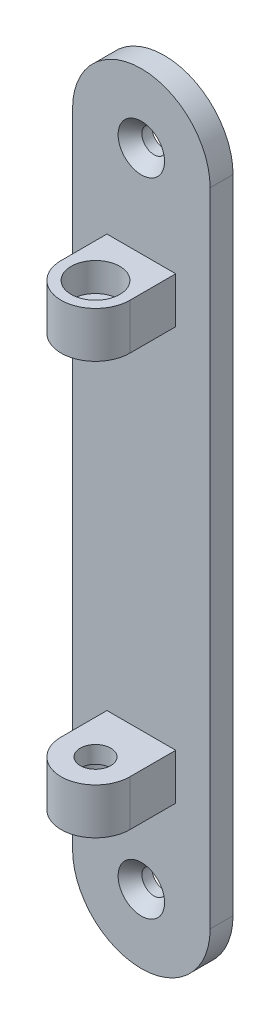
ISO-10303-21;
HEADER;
FILE_DESCRIPTION(('STEP AP214'),'2;1');
FILE_NAME('part.step','',(''),(''),'','','');
FILE_SCHEMA(('AUTOMOTIVE_DESIGN { 1 0 10303 214 1 1 1 1 }'));
ENDSEC;
DATA;
#1=APPLICATION_CONTEXT('core data for automotive mechanical design processes');
#2=APPLICATION_PROTOCOL_DEFINITION('international standard','automotive_design',2000,#1);
#3=PRODUCT_CONTEXT('',#1,'mechanical');
#4=PRODUCT('Part','Part','',(#3));
#5=PRODUCT_RELATED_PRODUCT_CATEGORY('part','',(#4));
#6=PRODUCT_DEFINITION_FORMATION('','',#4);
#7=PRODUCT_DEFINITION_CONTEXT('part definition',#1,'design');
#8=PRODUCT_DEFINITION('design','',#6,#7);
#9=PRODUCT_DEFINITION_SHAPE('','',#8);
#10=(LENGTH_UNIT() NAMED_UNIT(*) SI_UNIT(.MILLI.,.METRE.));
#11=(NAMED_UNIT(*) PLANE_ANGLE_UNIT() SI_UNIT($,.RADIAN.));
#12=(NAMED_UNIT(*) SI_UNIT($,.STERADIAN.) SOLID_ANGLE_UNIT());
#13=UNCERTAINTY_MEASURE_WITH_UNIT(LENGTH_MEASURE(1.E-05),#10,'distance_accuracy_value','');
#14=(GEOMETRIC_REPRESENTATION_CONTEXT(3) GLOBAL_UNCERTAINTY_ASSIGNED_CONTEXT((#13)) GLOBAL_UNIT_ASSIGNED_CONTEXT((#10,
#11,#12)) REPRESENTATION_CONTEXT('',''));
#15=CARTESIAN_POINT('',(0.,0.,0.));
#16=DIRECTION('',(0.,0.,1.));
#17=DIRECTION('',(1.,0.,0.));
#18=AXIS2_PLACEMENT_3D('',#15,#16,#17);
#19=CARTESIAN_POINT('',(19.05,88.9,6.35));
#20=DIRECTION('',(0.,0.,-1.));
#21=DIRECTION('',(-1.,0.,0.));
#22=AXIS2_PLACEMENT_3D('',#19,#20,#21);
#23=PLANE('',#22);
#24=DIRECTION('',(0.,-1.,0.));
#25=VECTOR('',#24,1.);
#26=CARTESIAN_POINT('',(9.525,63.5,6.35));
#27=LINE('',#26,#25);
#28=CARTESIAN_POINT('',(9.525,63.5,6.35));
#29=VERTEX_POINT('',#28);
#30=CARTESIAN_POINT('',(9.525,50.8,6.35));
#31=VERTEX_POINT('',#30);
#32=EDGE_CURVE('E189',#29,#31,#27,.T.);
#33=ORIENTED_EDGE('',*,*,#32,.F.);
#34=DIRECTION('',(-1.,0.,0.));
#35=VECTOR('',#34,1.);
#36=CARTESIAN_POINT('',(9.525,63.5,6.35));
#37=LINE('',#36,#35);
#38=CARTESIAN_POINT('',(28.575,63.5,6.35));
#39=VERTEX_POINT('',#38);
#40=EDGE_CURVE('E200',#39,#29,#37,.T.);
#41=ORIENTED_EDGE('',*,*,#40,.F.);
#42=DIRECTION('',(0.,1.,0.));
#43=VECTOR('',#42,1.);
#44=CARTESIAN_POINT('',(28.575,63.5,6.35));
#45=LINE('',#44,#43);
#46=CARTESIAN_POINT('',(28.575,50.8,6.35));
#47=VERTEX_POINT('',#46);
#48=EDGE_CURVE('E197',#47,#39,#45,.T.);
#49=ORIENTED_EDGE('',*,*,#48,.F.);
#50=DIRECTION('',(1.,0.,0.));
#51=VECTOR('',#50,1.);
#52=CARTESIAN_POINT('',(9.52500000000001,50.8,6.35));
#53=LINE('',#52,#51);
#54=EDGE_CURVE('E194',#31,#47,#53,.T.);
#55=ORIENTED_EDGE('',*,*,#54,.F.);
#56=EDGE_LOOP('',(#33,#41,#49,#55));
#57=FACE_BOUND('',#56,.T.);
#58=CARTESIAN_POINT('',(19.05,88.9,6.35));
#59=DIRECTION('',(0.,0.,1.));
#60=DIRECTION('',(1.,0.,0.));
#61=AXIS2_PLACEMENT_3D('',#58,#59,#60);
#62=CIRCLE('',#61,6.4389);
#63=CARTESIAN_POINT('',(25.4889,88.9,6.35));
#64=VERTEX_POINT('',#63);
#65=EDGE_CURVE('E221',#64,#64,#62,.T.);
#66=ORIENTED_EDGE('',*,*,#65,.F.);
#67=EDGE_LOOP('',(#66));
#68=FACE_BOUND('',#67,.T.);
#69=CARTESIAN_POINT('',(19.05,88.9,6.35));
#70=DIRECTION('',(0.,0.,1.));
#71=DIRECTION('',(-1.,0.,0.));
#72=AXIS2_PLACEMENT_3D('',#69,#70,#71);
#73=CIRCLE('',#72,19.05);
#74=CARTESIAN_POINT('',(38.1,88.9,6.35));
#75=VERTEX_POINT('',#74);
#76=CARTESIAN_POINT('',(0.,88.9,6.35));
#77=VERTEX_POINT('',#76);
#78=EDGE_CURVE('E239',#75,#77,#73,.T.);
#79=ORIENTED_EDGE('',*,*,#78,.T.);
#80=DIRECTION('',(0.,-1.,0.));
#81=VECTOR('',#80,1.);
#82=CARTESIAN_POINT('',(0.,-88.9,6.35));
#83=LINE('',#82,#81);
#84=CARTESIAN_POINT('',(0.,-88.9,6.35));
#85=VERTEX_POINT('',#84);
#86=EDGE_CURVE('E242',#77,#85,#83,.T.);
#87=ORIENTED_EDGE('',*,*,#86,.T.);
#88=CARTESIAN_POINT('',(19.05,-88.9,6.35));
#89=DIRECTION('',(0.,0.,1.));
#90=DIRECTION('',(1.,0.,0.));
#91=AXIS2_PLACEMENT_3D('',#88,#89,#90);
#92=CIRCLE('',#91,19.05);
#93=CARTESIAN_POINT('',(38.1,-88.9,6.35));
#94=VERTEX_POINT('',#93);
#95=EDGE_CURVE('E244',#85,#94,#92,.T.);
#96=ORIENTED_EDGE('',*,*,#95,.T.);
#97=DIRECTION('',(0.,1.,0.));
#98=VECTOR('',#97,1.);
#99=CARTESIAN_POINT('',(38.1,88.9,6.35));
#100=LINE('',#99,#98);
#101=EDGE_CURVE('E246',#94,#75,#100,.T.);
#102=ORIENTED_EDGE('',*,*,#101,.T.);
#103=EDGE_LOOP('',(#79,#87,#96,#102));
#104=FACE_BOUND('',#103,.T.);
#105=CARTESIAN_POINT('',(19.05,-88.9,6.35));
#106=DIRECTION('',(0.,0.,-1.));
#107=DIRECTION('',(1.,0.,0.));
#108=AXIS2_PLACEMENT_3D('',#105,#106,#107);
#109=CIRCLE('',#108,6.4389);
#110=CARTESIAN_POINT('',(25.4889,-88.9,6.35));
#111=VERTEX_POINT('',#110);
#112=EDGE_CURVE('E164',#111,#111,#109,.T.);
#113=ORIENTED_EDGE('',*,*,#112,.T.);
#114=EDGE_LOOP('',(#113));
#115=FACE_BOUND('',#114,.T.);
#116=DIRECTION('',(-1.,0.,0.));
#117=VECTOR('',#116,1.);
#118=CARTESIAN_POINT('',(9.525,-63.5,6.35));
#119=LINE('',#118,#117);
#120=CARTESIAN_POINT('',(28.575,-63.5,6.35));
#121=VERTEX_POINT('',#120);
#122=CARTESIAN_POINT('',(9.525,-63.5,6.35));
#123=VERTEX_POINT('',#122);
#124=EDGE_CURVE('E42',#121,#123,#119,.T.);
#125=ORIENTED_EDGE('',*,*,#124,.T.);
#126=DIRECTION('',(0.,1.,0.));
#127=VECTOR('',#126,1.);
#128=CARTESIAN_POINT('',(9.525,-63.5,6.35));
#129=LINE('',#128,#127);
#130=CARTESIAN_POINT('',(9.525,-50.8,6.35));
#131=VERTEX_POINT('',#130);
#132=EDGE_CURVE('E162',#123,#131,#129,.T.);
#133=ORIENTED_EDGE('',*,*,#132,.T.);
#134=DIRECTION('',(1.,0.,0.));
#135=VECTOR('',#134,1.);
#136=CARTESIAN_POINT('',(9.52500000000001,-50.8,6.35));
#137=LINE('',#136,#135);
#138=CARTESIAN_POINT('',(28.575,-50.8,6.35));
#139=VERTEX_POINT('',#138);
#140=EDGE_CURVE('E137',#131,#139,#137,.T.);
#141=ORIENTED_EDGE('',*,*,#140,.T.);
#142=DIRECTION('',(0.,-1.,0.));
#143=VECTOR('',#142,1.);
#144=CARTESIAN_POINT('',(28.575,-63.5,6.35));
#145=LINE('',#144,#143);
#146=EDGE_CURVE('E47',#139,#121,#145,.T.);
#147=ORIENTED_EDGE('',*,*,#146,.T.);
#148=EDGE_LOOP('',(#125,#133,#141,#147));
#149=FACE_BOUND('',#148,.T.);
#150=ADVANCED_FACE('F27',(#57,#68,#104,#115,#149),#23,.F.);
#151=CARTESIAN_POINT('',(9.52500000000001,50.8,19.05));
#152=DIRECTION('',(0.,1.,0.));
#153=DIRECTION('',(0.,0.,1.));
#154=AXIS2_PLACEMENT_3D('',#151,#152,#153);
#155=PLANE('',#154);
#156=ORIENTED_EDGE('',*,*,#54,.T.);
#157=DIRECTION('',(0.,0.,-1.));
#158=VECTOR('',#157,1.);
#159=CARTESIAN_POINT('',(28.575,50.8,19.05));
#160=LINE('',#159,#158);
#161=CARTESIAN_POINT('',(28.575,50.8,19.05));
#162=VERTEX_POINT('',#161);
#163=EDGE_CURVE('E215',#162,#47,#160,.T.);
#164=ORIENTED_EDGE('',*,*,#163,.F.);
#165=CARTESIAN_POINT('',(19.05,50.8,19.05));
#166=DIRECTION('',(0.,1.,0.));
#167=DIRECTION('',(0.,0.,1.));
#168=AXIS2_PLACEMENT_3D('',#165,#166,#167);
#169=CIRCLE('',#168,9.525);
#170=CARTESIAN_POINT('',(9.52500000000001,50.8,19.05));
#171=VERTEX_POINT('',#170);
#172=EDGE_CURVE('E186',#162,#171,#169,.F.);
#173=ORIENTED_EDGE('',*,*,#172,.T.);
#174=DIRECTION('',(0.,0.,-1.));
#175=VECTOR('',#174,1.);
#176=CARTESIAN_POINT('',(9.52500000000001,50.8,19.05));
#177=LINE('',#176,#175);
#178=EDGE_CURVE('E218',#171,#31,#177,.T.);
#179=ORIENTED_EDGE('',*,*,#178,.T.);
#180=EDGE_LOOP('',(#156,#164,#173,#179));
#181=FACE_BOUND('',#180,.T.);
#182=CARTESIAN_POINT('',(19.05,50.8,19.05));
#183=DIRECTION('',(0.,1.,0.));
#184=DIRECTION('',(0.,0.,1.));
#185=AXIS2_PLACEMENT_3D('',#182,#183,#184);
#186=CIRCLE('',#185,4.2164);
#187=CARTESIAN_POINT('',(19.05,50.8,23.2664));
#188=VERTEX_POINT('',#187);
#189=EDGE_CURVE('E182',#188,#188,#186,.F.);
#190=ORIENTED_EDGE('',*,*,#189,.F.);
#191=EDGE_LOOP('',(#190));
#192=FACE_BOUND('',#191,.T.);
#193=ADVANCED_FACE('F281',(#181,#192),#155,.F.);
#194=CARTESIAN_POINT('',(19.05,88.9,6.35));
#195=DIRECTION('',(0.,0.,-1.));
#196=DIRECTION('',(-1.,0.,0.));
#197=AXIS2_PLACEMENT_3D('',#194,#195,#196);
#198=CYLINDRICAL_SURFACE('',#197,19.05);
#199=CARTESIAN_POINT('',(19.05,88.9,0.));
#200=DIRECTION('',(0.,0.,1.));
#201=DIRECTION('',(-1.,0.,0.));
#202=AXIS2_PLACEMENT_3D('',#199,#200,#201);
#203=CIRCLE('',#202,19.05);
#204=CARTESIAN_POINT('',(38.1,88.9,0.));
#205=VERTEX_POINT('',#204);
#206=CARTESIAN_POINT('',(0.,88.9,0.));
#207=VERTEX_POINT('',#206);
#208=EDGE_CURVE('E230',#205,#207,#203,.T.);
#209=ORIENTED_EDGE('',*,*,#208,.T.);
#210=DIRECTION('',(0.,0.,-1.));
#211=VECTOR('',#210,1.);
#212=CARTESIAN_POINT('',(0.,88.9,6.35));
#213=LINE('',#212,#211);
#214=EDGE_CURVE('E11',#77,#207,#213,.T.);
#215=ORIENTED_EDGE('',*,*,#214,.F.);
#216=ORIENTED_EDGE('',*,*,#78,.F.);
#217=DIRECTION('',(0.,0.,-1.));
#218=VECTOR('',#217,1.);
#219=CARTESIAN_POINT('',(38.1,88.9,6.35));
#220=LINE('',#219,#218);
#221=EDGE_CURVE('E248',#75,#205,#220,.T.);
#222=ORIENTED_EDGE('',*,*,#221,.T.);
#223=EDGE_LOOP('',(#209,#215,#216,#222));
#224=FACE_BOUND('',#223,.T.);
#225=ADVANCED_FACE('F29',(#224),#198,.T.);
#226=CARTESIAN_POINT('',(0.,-88.9,6.35));
#227=DIRECTION('',(1.,0.,0.));
#228=DIRECTION('',(0.,0.,-1.));
#229=AXIS2_PLACEMENT_3D('',#226,#227,#228);
#230=PLANE('',#229);
#231=DIRECTION('',(0.,-1.,0.));
#232=VECTOR('',#231,1.);
#233=CARTESIAN_POINT('',(0.,-88.9,0.));
#234=LINE('',#233,#232);
#235=CARTESIAN_POINT('',(0.,-88.9,0.));
#236=VERTEX_POINT('',#235);
#237=EDGE_CURVE('E233',#207,#236,#234,.T.);
#238=ORIENTED_EDGE('',*,*,#237,.T.);
#239=DIRECTION('',(0.,0.,-1.));
#240=VECTOR('',#239,1.);
#241=CARTESIAN_POINT('',(0.,-88.9,6.35));
#242=LINE('',#241,#240);
#243=EDGE_CURVE('E35',#85,#236,#242,.T.);
#244=ORIENTED_EDGE('',*,*,#243,.F.);
#245=ORIENTED_EDGE('',*,*,#86,.F.);
#246=ORIENTED_EDGE('',*,*,#214,.T.);
#247=EDGE_LOOP('',(#238,#244,#245,#246));
#248=FACE_BOUND('',#247,.T.);
#249=ADVANCED_FACE('F274',(#248),#230,.F.);
#250=CARTESIAN_POINT('',(19.05,-88.9,6.35));
#251=DIRECTION('',(0.,0.,-1.));
#252=DIRECTION('',(-1.,0.,0.));
#253=AXIS2_PLACEMENT_3D('',#250,#251,#252);
#254=CYLINDRICAL_SURFACE('',#253,19.05);
#255=CARTESIAN_POINT('',(19.05,-88.9,0.));
#256=DIRECTION('',(0.,0.,1.));
#257=DIRECTION('',(1.,0.,0.));
#258=AXIS2_PLACEMENT_3D('',#255,#256,#257);
#259=CIRCLE('',#258,19.05);
#260=CARTESIAN_POINT('',(38.1,-88.9,0.));
#261=VERTEX_POINT('',#260);
#262=EDGE_CURVE('E235',#236,#261,#259,.T.);
#263=ORIENTED_EDGE('',*,*,#262,.T.);
#264=DIRECTION('',(0.,0.,-1.));
#265=VECTOR('',#264,1.);
#266=CARTESIAN_POINT('',(38.1,-88.9,6.35));
#267=LINE('',#266,#265);
#268=EDGE_CURVE('E251',#94,#261,#267,.T.);
#269=ORIENTED_EDGE('',*,*,#268,.F.);
#270=ORIENTED_EDGE('',*,*,#95,.F.);
#271=ORIENTED_EDGE('',*,*,#243,.T.);
#272=EDGE_LOOP('',(#263,#269,#270,#271));
#273=FACE_BOUND('',#272,.T.);
#274=ADVANCED_FACE('F258',(#273),#254,.T.);
#275=CARTESIAN_POINT('',(38.1,88.9,6.35));
#276=DIRECTION('',(-1.,0.,0.));
#277=DIRECTION('',(0.,0.,1.));
#278=AXIS2_PLACEMENT_3D('',#275,#276,#277);
#279=PLANE('',#278);
#280=DIRECTION('',(0.,1.,0.));
#281=VECTOR('',#280,1.);
#282=CARTESIAN_POINT('',(38.1,88.9,0.));
#283=LINE('',#282,#281);
#284=EDGE_CURVE('E237',#261,#205,#283,.T.);
#285=ORIENTED_EDGE('',*,*,#284,.T.);
#286=ORIENTED_EDGE('',*,*,#221,.F.);
#287=ORIENTED_EDGE('',*,*,#101,.F.);
#288=ORIENTED_EDGE('',*,*,#268,.T.);
#289=EDGE_LOOP('',(#285,#286,#287,#288));
#290=FACE_BOUND('',#289,.T.);
#291=ADVANCED_FACE('F267',(#290),#279,.F.);
#292=CARTESIAN_POINT('',(19.05,88.9,0.));
#293=DIRECTION('',(0.,0.,-1.));
#294=DIRECTION('',(-1.,0.,0.));
#295=AXIS2_PLACEMENT_3D('',#292,#293,#294);
#296=PLANE('',#295);
#297=CARTESIAN_POINT('',(19.05,-88.9,0.));
#298=DIRECTION('',(0.,0.,-1.));
#299=DIRECTION('',(1.,0.,0.));
#300=AXIS2_PLACEMENT_3D('',#297,#298,#299);
#301=CIRCLE('',#300,3.3782);
#302=CARTESIAN_POINT('',(22.4282,-88.9,0.));
#303=VERTEX_POINT('',#302);
#304=EDGE_CURVE('E167',#303,#303,#301,.T.);
#305=ORIENTED_EDGE('',*,*,#304,.F.);
#306=EDGE_LOOP('',(#305));
#307=FACE_BOUND('',#306,.T.);
#308=CARTESIAN_POINT('',(19.05,88.9,0.));
#309=DIRECTION('',(0.,0.,1.));
#310=DIRECTION('',(1.,0.,0.));
#311=AXIS2_PLACEMENT_3D('',#308,#309,#310);
#312=CIRCLE('',#311,3.3782);
#313=CARTESIAN_POINT('',(22.4282,88.9,0.));
#314=VERTEX_POINT('',#313);
#315=EDGE_CURVE('E227',#314,#314,#312,.T.);
#316=ORIENTED_EDGE('',*,*,#315,.T.);
#317=EDGE_LOOP('',(#316));
#318=FACE_BOUND('',#317,.T.);
#319=ORIENTED_EDGE('',*,*,#208,.F.);
#320=ORIENTED_EDGE('',*,*,#284,.F.);
#321=ORIENTED_EDGE('',*,*,#262,.F.);
#322=ORIENTED_EDGE('',*,*,#237,.F.);
#323=EDGE_LOOP('',(#319,#320,#321,#322));
#324=FACE_BOUND('',#323,.T.);
#325=ADVANCED_FACE('F264',(#307,#318,#324),#296,.T.);
#326=CARTESIAN_POINT('',(19.05,88.9,6.35));
#327=DIRECTION('',(0.,0.,1.));
#328=DIRECTION('',(1.,0.,0.));
#329=AXIS2_PLACEMENT_3D('',#326,#327,#328);
#330=CYLINDRICAL_SURFACE('',#329,3.37819999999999);
#331=ORIENTED_EDGE('',*,*,#315,.F.);
#332=EDGE_LOOP('',(#331));
#333=FACE_BOUND('',#332,.T.);
#334=CARTESIAN_POINT('',(19.05,88.9,2.82906741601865));
#335=DIRECTION('',(0.,0.,1.));
#336=DIRECTION('',(1.,0.,0.));
#337=AXIS2_PLACEMENT_3D('',#334,#335,#336);
#338=CIRCLE('',#337,3.37819999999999);
#339=CARTESIAN_POINT('',(22.4282,88.9,2.82906741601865));
#340=VERTEX_POINT('',#339);
#341=EDGE_CURVE('E224',#340,#340,#338,.T.);
#342=ORIENTED_EDGE('',*,*,#341,.T.);
#343=EDGE_LOOP('',(#342));
#344=FACE_BOUND('',#343,.T.);
#345=ADVANCED_FACE('F300',(#333,#344),#330,.F.);
#346=CARTESIAN_POINT('',(19.05,88.9,6.35));
#347=DIRECTION('',(0.,0.,1.));
#348=DIRECTION('',(1.,0.,0.));
#349=AXIS2_PLACEMENT_3D('',#346,#347,#348);
#350=CONICAL_SURFACE('',#349,6.4389,0.715584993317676);
#351=ORIENTED_EDGE('',*,*,#341,.F.);
#352=EDGE_LOOP('',(#351));
#353=FACE_BOUND('',#352,.T.);
#354=ORIENTED_EDGE('',*,*,#65,.T.);
#355=EDGE_LOOP('',(#354));
#356=FACE_BOUND('',#355,.T.);
#357=ADVANCED_FACE('F305',(#353,#356),#350,.F.);
#358=CARTESIAN_POINT('',(9.525,63.5,19.05));
#359=DIRECTION('',(1.,0.,0.));
#360=DIRECTION('',(0.,1.,0.));
#361=AXIS2_PLACEMENT_3D('',#358,#359,#360);
#362=PLANE('',#361);
#363=ORIENTED_EDGE('',*,*,#32,.T.);
#364=ORIENTED_EDGE('',*,*,#178,.F.);
#365=DIRECTION('',(0.,-1.,0.));
#366=VECTOR('',#365,1.);
#367=CARTESIAN_POINT('',(9.525,63.5,19.05));
#368=LINE('',#367,#366);
#369=CARTESIAN_POINT('',(9.525,63.5,19.05));
#370=VERTEX_POINT('',#369);
#371=EDGE_CURVE('E203',#370,#171,#368,.T.);
#372=ORIENTED_EDGE('',*,*,#371,.F.);
#373=DIRECTION('',(0.,0.,-1.));
#374=VECTOR('',#373,1.);
#375=CARTESIAN_POINT('',(9.525,63.5,19.05));
#376=LINE('',#375,#374);
#377=EDGE_CURVE('E209',#370,#29,#376,.T.);
#378=ORIENTED_EDGE('',*,*,#377,.T.);
#379=EDGE_LOOP('',(#363,#364,#372,#378));
#380=FACE_BOUND('',#379,.T.);
#381=ADVANCED_FACE('F315',(#380),#362,.F.);
#382=CARTESIAN_POINT('',(28.575,63.5,19.05));
#383=DIRECTION('',(-1.,0.,0.));
#384=DIRECTION('',(0.,-1.,0.));
#385=AXIS2_PLACEMENT_3D('',#382,#383,#384);
#386=PLANE('',#385);
#387=ORIENTED_EDGE('',*,*,#48,.T.);
#388=DIRECTION('',(0.,0.,-1.));
#389=VECTOR('',#388,1.);
#390=CARTESIAN_POINT('',(28.575,63.5,19.05));
#391=LINE('',#390,#389);
#392=CARTESIAN_POINT('',(28.575,63.5,19.05));
#393=VERTEX_POINT('',#392);
#394=EDGE_CURVE('E212',#393,#39,#391,.T.);
#395=ORIENTED_EDGE('',*,*,#394,.F.);
#396=DIRECTION('',(0.,1.,0.));
#397=VECTOR('',#396,1.);
#398=CARTESIAN_POINT('',(28.575,63.5,19.05));
#399=LINE('',#398,#397);
#400=EDGE_CURVE('E206',#162,#393,#399,.T.);
#401=ORIENTED_EDGE('',*,*,#400,.F.);
#402=ORIENTED_EDGE('',*,*,#163,.T.);
#403=EDGE_LOOP('',(#387,#395,#401,#402));
#404=FACE_BOUND('',#403,.T.);
#405=ADVANCED_FACE('F321',(#404),#386,.F.);
#406=CARTESIAN_POINT('',(9.525,63.5,19.05));
#407=DIRECTION('',(0.,-1.,0.));
#408=DIRECTION('',(1.,0.,0.));
#409=AXIS2_PLACEMENT_3D('',#406,#407,#408);
#410=PLANE('',#409);
#411=CARTESIAN_POINT('',(19.05,63.5,19.05));
#412=DIRECTION('',(0.,1.,0.));
#413=DIRECTION('',(0.,0.,1.));
#414=AXIS2_PLACEMENT_3D('',#411,#412,#413);
#415=CIRCLE('',#414,6.74750999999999);
#416=CARTESIAN_POINT('',(19.05,63.5,25.79751));
#417=VERTEX_POINT('',#416);
#418=EDGE_CURVE('E173',#417,#417,#415,.T.);
#419=ORIENTED_EDGE('',*,*,#418,.F.);
#420=EDGE_LOOP('',(#419));
#421=FACE_BOUND('',#420,.T.);
#422=ORIENTED_EDGE('',*,*,#40,.T.);
#423=ORIENTED_EDGE('',*,*,#377,.F.);
#424=CARTESIAN_POINT('',(19.05,63.5,19.05));
#425=DIRECTION('',(0.,1.,0.));
#426=DIRECTION('',(1.,0.,0.));
#427=AXIS2_PLACEMENT_3D('',#424,#425,#426);
#428=CIRCLE('',#427,9.525);
#429=EDGE_CURVE('E185',#370,#393,#428,.T.);
#430=ORIENTED_EDGE('',*,*,#429,.T.);
#431=ORIENTED_EDGE('',*,*,#394,.T.);
#432=EDGE_LOOP('',(#422,#423,#430,#431));
#433=FACE_BOUND('',#432,.T.);
#434=ADVANCED_FACE('F327',(#421,#433),#410,.F.);
#435=CARTESIAN_POINT('',(19.05,29.5014525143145,19.05));
#436=DIRECTION('',(0.,1.,0.));
#437=DIRECTION('',(-1.,0.,0.));
#438=AXIS2_PLACEMENT_3D('',#435,#436,#437);
#439=CYLINDRICAL_SURFACE('',#438,9.525);
#440=ORIENTED_EDGE('',*,*,#172,.F.);
#441=ORIENTED_EDGE('',*,*,#400,.T.);
#442=ORIENTED_EDGE('',*,*,#429,.F.);
#443=ORIENTED_EDGE('',*,*,#371,.T.);
#444=EDGE_LOOP('',(#440,#441,#442,#443));
#445=FACE_BOUND('',#444,.T.);
#446=ADVANCED_FACE('F331',(#445),#439,.T.);
#447=CARTESIAN_POINT('',(19.05,63.5,19.05));
#448=DIRECTION('',(0.,1.,0.));
#449=DIRECTION('',(0.,0.,1.));
#450=AXIS2_PLACEMENT_3D('',#447,#448,#449);
#451=CYLINDRICAL_SURFACE('',#450,4.2164);
#452=ORIENTED_EDGE('',*,*,#189,.T.);
#453=EDGE_LOOP('',(#452));
#454=FACE_BOUND('',#453,.T.);
#455=CARTESIAN_POINT('',(19.05,55.5625,19.05));
#456=DIRECTION('',(0.,1.,0.));
#457=DIRECTION('',(0.,0.,1.));
#458=AXIS2_PLACEMENT_3D('',#455,#456,#457);
#459=CIRCLE('',#458,4.2164);
#460=CARTESIAN_POINT('',(19.05,55.5625,23.2664));
#461=VERTEX_POINT('',#460);
#462=EDGE_CURVE('E179',#461,#461,#459,.T.);
#463=ORIENTED_EDGE('',*,*,#462,.T.);
#464=EDGE_LOOP('',(#463));
#465=FACE_BOUND('',#464,.T.);
#466=ADVANCED_FACE('F335',(#454,#465),#451,.F.);
#467=CARTESIAN_POINT('',(23.2664,55.5625,19.05));
#468=DIRECTION('',(0.,-1.,0.));
#469=DIRECTION('',(0.,0.,-1.));
#470=AXIS2_PLACEMENT_3D('',#467,#468,#469);
#471=PLANE('',#470);
#472=ORIENTED_EDGE('',*,*,#462,.F.);
#473=EDGE_LOOP('',(#472));
#474=FACE_BOUND('',#473,.T.);
#475=CARTESIAN_POINT('',(19.05,55.5625,19.05));
#476=DIRECTION('',(0.,1.,0.));
#477=DIRECTION('',(0.,0.,1.));
#478=AXIS2_PLACEMENT_3D('',#475,#476,#477);
#479=CIRCLE('',#478,6.74750999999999);
#480=CARTESIAN_POINT('',(19.05,55.5625,25.79751));
#481=VERTEX_POINT('',#480);
#482=EDGE_CURVE('E176',#481,#481,#479,.T.);
#483=ORIENTED_EDGE('',*,*,#482,.T.);
#484=EDGE_LOOP('',(#483));
#485=FACE_BOUND('',#484,.T.);
#486=ADVANCED_FACE('F339',(#474,#485),#471,.F.);
#487=CARTESIAN_POINT('',(19.05,63.5,19.05));
#488=DIRECTION('',(0.,1.,0.));
#489=DIRECTION('',(0.,0.,1.));
#490=AXIS2_PLACEMENT_3D('',#487,#488,#489);
#491=CYLINDRICAL_SURFACE('',#490,6.74750999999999);
#492=ORIENTED_EDGE('',*,*,#482,.F.);
#493=EDGE_LOOP('',(#492));
#494=FACE_BOUND('',#493,.T.);
#495=ORIENTED_EDGE('',*,*,#418,.T.);
#496=EDGE_LOOP('',(#495));
#497=FACE_BOUND('',#496,.T.);
#498=ADVANCED_FACE('F343',(#494,#497),#491,.F.);
#499=CARTESIAN_POINT('',(19.05,-88.9,6.35));
#500=DIRECTION('',(0.,0.,1.));
#501=DIRECTION('',(1.,0.,0.));
#502=AXIS2_PLACEMENT_3D('',#499,#500,#501);
#503=CYLINDRICAL_SURFACE('',#502,3.37819999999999);
#504=ORIENTED_EDGE('',*,*,#304,.T.);
#505=EDGE_LOOP('',(#504));
#506=FACE_BOUND('',#505,.T.);
#507=CARTESIAN_POINT('',(19.05,-88.9,2.82906741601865));
#508=DIRECTION('',(0.,0.,-1.));
#509=DIRECTION('',(1.,0.,0.));
#510=AXIS2_PLACEMENT_3D('',#507,#508,#509);
#511=CIRCLE('',#510,3.37819999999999);
#512=CARTESIAN_POINT('',(22.4282,-88.9,2.82906741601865));
#513=VERTEX_POINT('',#512);
#514=EDGE_CURVE('E170',#513,#513,#511,.T.);
#515=ORIENTED_EDGE('',*,*,#514,.F.);
#516=EDGE_LOOP('',(#515));
#517=FACE_BOUND('',#516,.T.);
#518=ADVANCED_FACE('F346',(#506,#517),#503,.F.);
#519=CARTESIAN_POINT('',(19.05,-88.9,6.35));
#520=DIRECTION('',(0.,0.,1.));
#521=DIRECTION('',(1.,0.,0.));
#522=AXIS2_PLACEMENT_3D('',#519,#520,#521);
#523=CONICAL_SURFACE('',#522,6.4389,0.715584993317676);
#524=ORIENTED_EDGE('',*,*,#514,.T.);
#525=EDGE_LOOP('',(#524));
#526=FACE_BOUND('',#525,.T.);
#527=ORIENTED_EDGE('',*,*,#112,.F.);
#528=EDGE_LOOP('',(#527));
#529=FACE_BOUND('',#528,.T.);
#530=ADVANCED_FACE('F349',(#526,#529),#523,.F.);
#531=CARTESIAN_POINT('',(9.525,-63.5,19.05));
#532=DIRECTION('',(1.,0.,0.));
#533=DIRECTION('',(0.,-1.,0.));
#534=AXIS2_PLACEMENT_3D('',#531,#532,#533);
#535=PLANE('',#534);
#536=ORIENTED_EDGE('',*,*,#132,.F.);
#537=DIRECTION('',(0.,0.,-1.));
#538=VECTOR('',#537,1.);
#539=CARTESIAN_POINT('',(9.525,-63.5,19.05));
#540=LINE('',#539,#538);
#541=CARTESIAN_POINT('',(9.525,-63.5,19.05));
#542=VERTEX_POINT('',#541);
#543=EDGE_CURVE('E151',#542,#123,#540,.T.);
#544=ORIENTED_EDGE('',*,*,#543,.F.);
#545=DIRECTION('',(0.,1.,0.));
#546=VECTOR('',#545,1.);
#547=CARTESIAN_POINT('',(9.525,-63.5,19.05));
#548=LINE('',#547,#546);
#549=CARTESIAN_POINT('',(9.52500000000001,-50.8,19.05));
#550=VERTEX_POINT('',#549);
#551=EDGE_CURVE('E145',#542,#550,#548,.T.);
#552=ORIENTED_EDGE('',*,*,#551,.T.);
#553=DIRECTION('',(0.,0.,-1.));
#554=VECTOR('',#553,1.);
#555=CARTESIAN_POINT('',(9.52500000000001,-50.8,19.05));
#556=LINE('',#555,#554);
#557=EDGE_CURVE('E123',#550,#131,#556,.T.);
#558=ORIENTED_EDGE('',*,*,#557,.T.);
#559=EDGE_LOOP('',(#536,#544,#552,#558));
#560=FACE_BOUND('',#559,.T.);
#561=ADVANCED_FACE('F353',(#560),#535,.F.);
#562=CARTESIAN_POINT('',(28.575,-63.5,19.05));
#563=DIRECTION('',(-1.,0.,0.));
#564=DIRECTION('',(0.,1.,0.));
#565=AXIS2_PLACEMENT_3D('',#562,#563,#564);
#566=PLANE('',#565);
#567=ORIENTED_EDGE('',*,*,#146,.F.);
#568=DIRECTION('',(0.,0.,-1.));
#569=VECTOR('',#568,1.);
#570=CARTESIAN_POINT('',(28.575,-50.8,19.05));
#571=LINE('',#570,#569);
#572=CARTESIAN_POINT('',(28.575,-50.8,19.05));
#573=VERTEX_POINT('',#572);
#574=EDGE_CURVE('E121',#573,#139,#571,.T.);
#575=ORIENTED_EDGE('',*,*,#574,.F.);
#576=DIRECTION('',(0.,-1.,0.));
#577=VECTOR('',#576,1.);
#578=CARTESIAN_POINT('',(28.575,-63.5,19.05));
#579=LINE('',#578,#577);
#580=CARTESIAN_POINT('',(28.575,-63.5,19.05));
#581=VERTEX_POINT('',#580);
#582=EDGE_CURVE('E129',#573,#581,#579,.T.);
#583=ORIENTED_EDGE('',*,*,#582,.T.);
#584=DIRECTION('',(0.,0.,-1.));
#585=VECTOR('',#584,1.);
#586=CARTESIAN_POINT('',(28.575,-63.5,19.05));
#587=LINE('',#586,#585);
#588=EDGE_CURVE('E153',#581,#121,#587,.T.);
#589=ORIENTED_EDGE('',*,*,#588,.T.);
#590=EDGE_LOOP('',(#567,#575,#583,#589));
#591=FACE_BOUND('',#590,.T.);
#592=ADVANCED_FACE('F136',(#591),#566,.F.);
#593=CARTESIAN_POINT('',(19.05,-63.5,19.05));
#594=DIRECTION('',(0.,-1.,0.));
#595=DIRECTION('',(0.,0.,1.));
#596=AXIS2_PLACEMENT_3D('',#593,#594,#595);
#597=CYLINDRICAL_SURFACE('',#596,4.2164);
#598=CARTESIAN_POINT('',(19.05,-50.8,19.05));
#599=DIRECTION('',(0.,1.,0.));
#600=DIRECTION('',(0.,0.,1.));
#601=AXIS2_PLACEMENT_3D('',#598,#599,#600);
#602=CIRCLE('',#601,4.2164);
#603=CARTESIAN_POINT('',(19.05,-50.8,23.2664));
#604=VERTEX_POINT('',#603);
#605=EDGE_CURVE('E134',#604,#604,#602,.F.);
#606=ORIENTED_EDGE('',*,*,#605,.F.);
#607=EDGE_LOOP('',(#606));
#608=FACE_BOUND('',#607,.T.);
#609=CARTESIAN_POINT('',(19.05,-55.5625,19.05));
#610=DIRECTION('',(0.,1.,0.));
#611=DIRECTION('',(0.,0.,1.));
#612=AXIS2_PLACEMENT_3D('',#609,#610,#611);
#613=CIRCLE('',#612,4.2164);
#614=CARTESIAN_POINT('',(19.05,-55.5625,23.2664));
#615=VERTEX_POINT('',#614);
#616=EDGE_CURVE('E158',#615,#615,#613,.T.);
#617=ORIENTED_EDGE('',*,*,#616,.F.);
#618=EDGE_LOOP('',(#617));
#619=FACE_BOUND('',#618,.T.);
#620=ADVANCED_FACE('F360',(#608,#619),#597,.F.);
#621=CARTESIAN_POINT('',(23.2664,-55.5625,19.05));
#622=DIRECTION('',(0.,1.,0.));
#623=DIRECTION('',(0.,0.,-1.));
#624=AXIS2_PLACEMENT_3D('',#621,#622,#623);
#625=PLANE('',#624);
#626=ORIENTED_EDGE('',*,*,#616,.T.);
#627=EDGE_LOOP('',(#626));
#628=FACE_BOUND('',#627,.T.);
#629=CARTESIAN_POINT('',(19.05,-55.5625,19.05));
#630=DIRECTION('',(0.,1.,0.));
#631=DIRECTION('',(0.,0.,1.));
#632=AXIS2_PLACEMENT_3D('',#629,#630,#631);
#633=CIRCLE('',#632,6.74750999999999);
#634=CARTESIAN_POINT('',(19.05,-55.5625,25.79751));
#635=VERTEX_POINT('',#634);
#636=EDGE_CURVE('E155',#635,#635,#633,.T.);
#637=ORIENTED_EDGE('',*,*,#636,.F.);
#638=EDGE_LOOP('',(#637));
#639=FACE_BOUND('',#638,.T.);
#640=ADVANCED_FACE('F363',(#628,#639),#625,.F.);
#641=CARTESIAN_POINT('',(19.05,-63.5,19.05));
#642=DIRECTION('',(0.,-1.,0.));
#643=DIRECTION('',(0.,0.,1.));
#644=AXIS2_PLACEMENT_3D('',#641,#642,#643);
#645=CYLINDRICAL_SURFACE('',#644,6.74750999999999);
#646=ORIENTED_EDGE('',*,*,#636,.T.);
#647=EDGE_LOOP('',(#646));
#648=FACE_BOUND('',#647,.T.);
#649=CARTESIAN_POINT('',(19.05,-63.5,19.05));
#650=DIRECTION('',(0.,1.,0.));
#651=DIRECTION('',(0.,0.,1.));
#652=AXIS2_PLACEMENT_3D('',#649,#650,#651);
#653=CIRCLE('',#652,6.74750999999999);
#654=CARTESIAN_POINT('',(19.05,-63.5,25.79751));
#655=VERTEX_POINT('',#654);
#656=EDGE_CURVE('E147',#655,#655,#653,.T.);
#657=ORIENTED_EDGE('',*,*,#656,.F.);
#658=EDGE_LOOP('',(#657));
#659=FACE_BOUND('',#658,.T.);
#660=ADVANCED_FACE('F367',(#648,#659),#645,.F.);
#661=CARTESIAN_POINT('',(9.525,-63.5,19.05));
#662=DIRECTION('',(0.,1.,0.));
#663=DIRECTION('',(1.,0.,0.));
#664=AXIS2_PLACEMENT_3D('',#661,#662,#663);
#665=PLANE('',#664);
#666=ORIENTED_EDGE('',*,*,#656,.T.);
#667=EDGE_LOOP('',(#666));
#668=FACE_BOUND('',#667,.T.);
#669=ORIENTED_EDGE('',*,*,#124,.F.);
#670=ORIENTED_EDGE('',*,*,#588,.F.);
#671=CARTESIAN_POINT('',(19.05,-63.5,19.05));
#672=DIRECTION('',(0.,1.,0.));
#673=DIRECTION('',(1.,0.,0.));
#674=AXIS2_PLACEMENT_3D('',#671,#672,#673);
#675=CIRCLE('',#674,9.525);
#676=EDGE_CURVE('E131',#542,#581,#675,.T.);
#677=ORIENTED_EDGE('',*,*,#676,.F.);
#678=ORIENTED_EDGE('',*,*,#543,.T.);
#679=EDGE_LOOP('',(#669,#670,#677,#678));
#680=FACE_BOUND('',#679,.T.);
#681=ADVANCED_FACE('F371',(#668,#680),#665,.F.);
#682=CARTESIAN_POINT('',(19.05,-29.5014525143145,19.05));
#683=DIRECTION('',(0.,-1.,0.));
#684=DIRECTION('',(-1.,0.,0.));
#685=AXIS2_PLACEMENT_3D('',#682,#683,#684);
#686=CYLINDRICAL_SURFACE('',#685,9.525);
#687=CARTESIAN_POINT('',(19.05,-50.8,19.05));
#688=DIRECTION('',(0.,1.,0.));
#689=DIRECTION('',(0.,0.,1.));
#690=AXIS2_PLACEMENT_3D('',#687,#688,#689);
#691=CIRCLE('',#690,9.525);
#692=EDGE_CURVE('E115',#573,#550,#691,.F.);
#693=ORIENTED_EDGE('',*,*,#692,.T.);
#694=ORIENTED_EDGE('',*,*,#551,.F.);
#695=ORIENTED_EDGE('',*,*,#676,.T.);
#696=ORIENTED_EDGE('',*,*,#582,.F.);
#697=EDGE_LOOP('',(#693,#694,#695,#696));
#698=FACE_BOUND('',#697,.T.);
#699=ADVANCED_FACE('F130',(#698),#686,.T.);
#700=CARTESIAN_POINT('',(9.52500000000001,-50.8,19.05));
#701=DIRECTION('',(0.,-1.,0.));
#702=DIRECTION('',(0.,0.,1.));
#703=AXIS2_PLACEMENT_3D('',#700,#701,#702);
#704=PLANE('',#703);
#705=ORIENTED_EDGE('',*,*,#140,.F.);
#706=ORIENTED_EDGE('',*,*,#557,.F.);
#707=ORIENTED_EDGE('',*,*,#692,.F.);
#708=ORIENTED_EDGE('',*,*,#574,.T.);
#709=EDGE_LOOP('',(#705,#706,#707,#708));
#710=FACE_BOUND('',#709,.T.);
#711=ORIENTED_EDGE('',*,*,#605,.T.);
#712=EDGE_LOOP('',(#711));
#713=FACE_BOUND('',#712,.T.);
#714=ADVANCED_FACE('F118',(#710,#713),#704,.F.);
#715=CLOSED_SHELL('',(#150,#193,#225,#249,#274,#291,#325,#345,#357,#381,#405,#434,#446,#466,
#486,#498,#518,#530,#561,#592,#620,#640,#660,#681,#699,#714));
#716=MANIFOLD_SOLID_BREP('B2',#715);
#717=ADVANCED_BREP_SHAPE_REPRESENTATION('',(#18,#716),#14);
#718=SHAPE_DEFINITION_REPRESENTATION(#9,#717);
ENDSEC;
END-ISO-10303-21;
